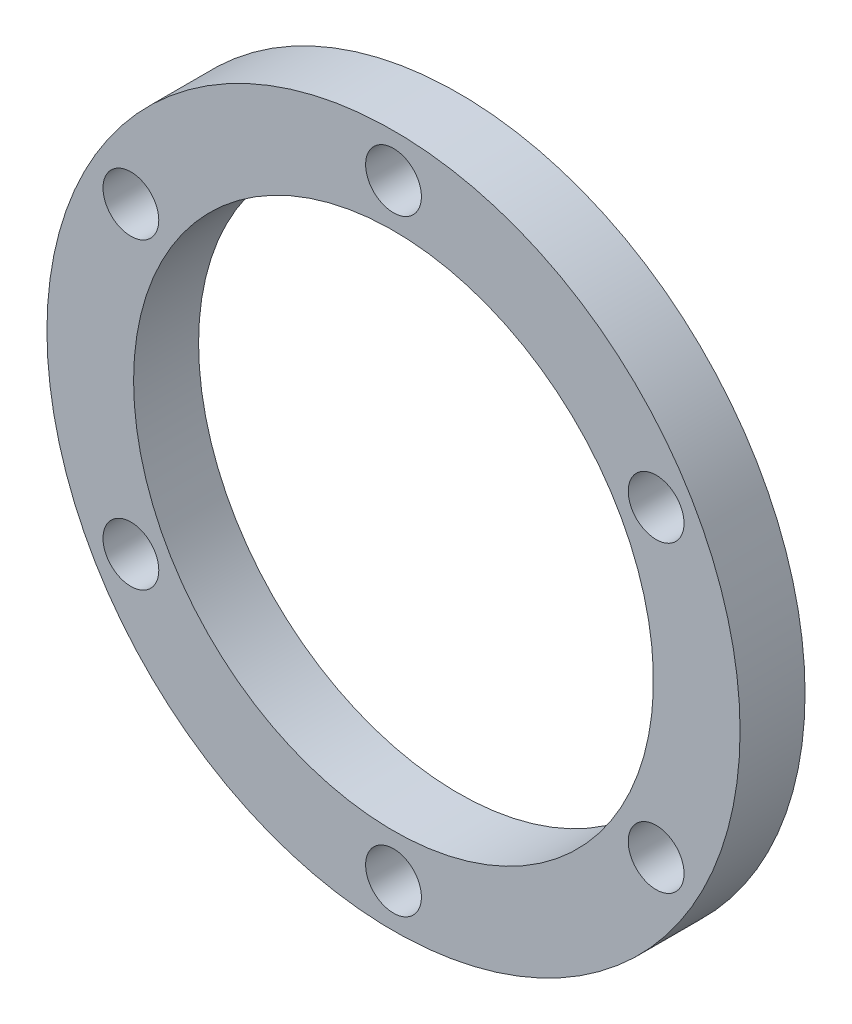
from build123d import *

# Parameters (mm, degrees)
SKETCH1_R                   = 25.4
SKETCH1_R_2                 = 19.05
BOSS_EXTRUDE1_DEPTH         = 4.7625
F_20_0_161_DIAMETER_HOLE1_D = 4.0894
CIRPATTERN1_COUNT           = 6


with BuildPart() as part:
    # Sketch1 → Boss-Extrude1 (new body)
    with BuildSketch(Plane.XY):
        with Locations(Location((0, 0, 0), (0, 0, 180))):
            Circle(SKETCH1_R)
        with Locations(Location((0, 0, 0), (0, 0, 180))):
            Circle(SKETCH1_R_2, mode=Mode.SUBTRACT)
    extrude(amount=BOSS_EXTRUDE1_DEPTH)

    # 20 _0.161_ Diameter Hole1 (through all)
    with Locations(Plane.XY.offset(4.7625)):
        with Locations((0, 22.225)):
            f_20_0_161_diameter_hole1 = Hole(F_20_0_161_DIAMETER_HOLE1_D / 2)

    # CirPattern1: 20 _0.161_ Diameter Hole1 ×6 about axis
    cirpattern1_axis = Axis((0, 0, 0), (0, 0, 1))
    for i in range(1, CIRPATTERN1_COUNT):
        add(f_20_0_161_diameter_hole1.rotate(cirpattern1_axis, i * 360 / CIRPATTERN1_COUNT), mode=Mode.SUBTRACT)


solid = part.part
